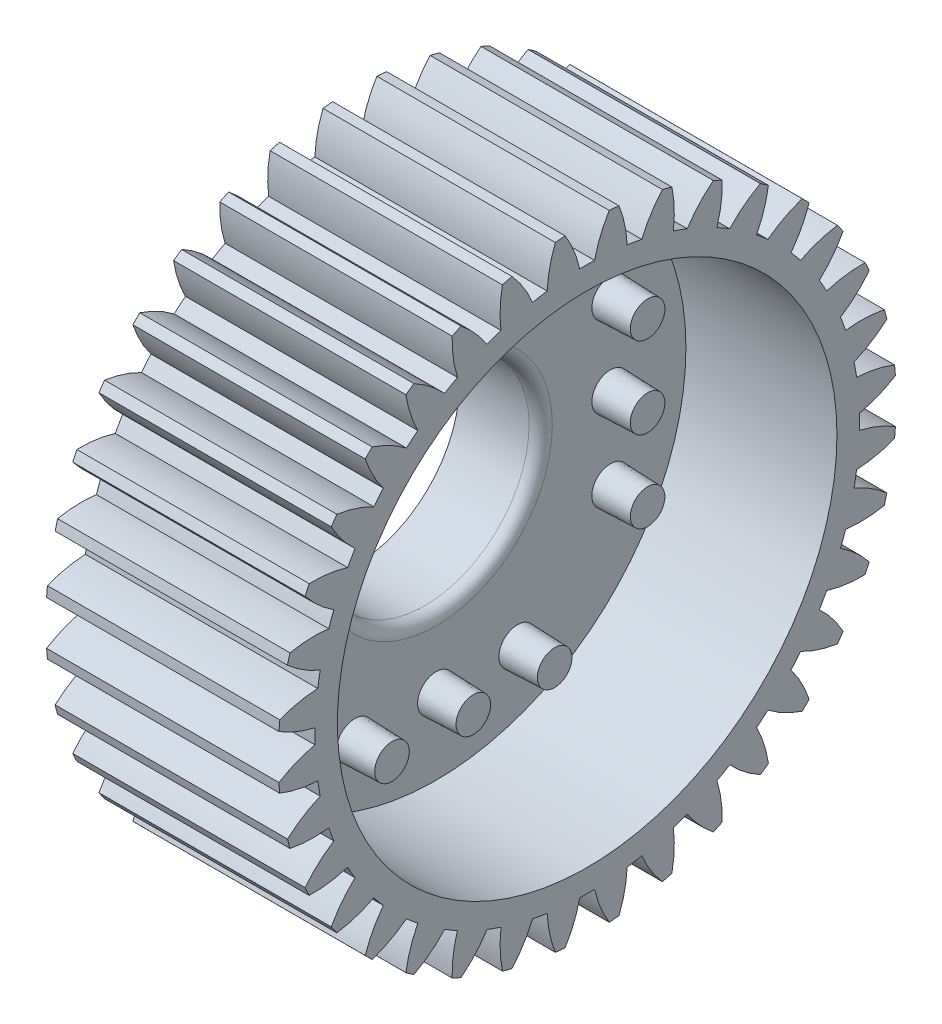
from build123d import *

# Parameters (mm, degrees)
BASPROSKE_W                    = 10
BASPROSKE_H                    = 13.3
TOOTHCUT_DEPTH                 = 22.302112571
TEETHCUTS_COUNT                = 36
BORSKE_R                       = 11
BORE_DEPTH                     = 50.0000508
BOSS_EXTRUDE1_START            = 3.5
SKETCH1_R                      = 11
SKETCH1_R_2                    = 4.5
BOSS_EXTRUDE1_DEPTH            = 3.5
SKETCH2_R                      = 11
SKETCH2_R_2                    = 10.75
BOSS_EXTRUDE2_DEPTH            = 10
SKETCH3_R                      = 0.8
BOSS_EXTRUDE3_DEPTH            = 1.6
BOSS_EXTRUDE3_DRAFT            = 2
BOSS_EXTRUDE3_PROFILE_2_DEPTH  = 1.6
BOSS_EXTRUDE3_PROFILE_2_DRAFT  = 2
BOSS_EXTRUDE3_PROFILE_3_DEPTH  = 1.6
BOSS_EXTRUDE3_PROFILE_3_DRAFT  = 2
BOSS_EXTRUDE3_PROFILE_4_DEPTH  = 1.6
BOSS_EXTRUDE3_PROFILE_4_DRAFT  = 2
BOSS_EXTRUDE3_PROFILE_5_DEPTH  = 1.6
BOSS_EXTRUDE3_PROFILE_5_DRAFT  = 2
BOSS_EXTRUDE3_PROFILE_6_DEPTH  = 1.6
BOSS_EXTRUDE3_PROFILE_6_DRAFT  = 2
BOSS_EXTRUDE3_PROFILE_7_DEPTH  = 1.6
BOSS_EXTRUDE3_PROFILE_7_DRAFT  = 2
BOSS_EXTRUDE3_PROFILE_8_DEPTH  = 1.6
BOSS_EXTRUDE3_PROFILE_8_DRAFT  = 2
BOSS_EXTRUDE3_PROFILE_9_DEPTH  = 1.6
BOSS_EXTRUDE3_PROFILE_9_DRAFT  = 2
BOSS_EXTRUDE3_PROFILE_10_DEPTH = 1.6
BOSS_EXTRUDE3_PROFILE_10_DRAFT = 2
BOSS_EXTRUDE3_PROFILE_11_DEPTH = 1.6
BOSS_EXTRUDE3_PROFILE_11_DRAFT = 2
BOSS_EXTRUDE3_PROFILE_12_DEPTH = 1.6
BOSS_EXTRUDE3_PROFILE_12_DRAFT = 2
FILLET1_R                      = 0.5


with BuildPart() as part:
    # BasProSke → Base-Revolve (revolve)
    with BuildSketch(Plane(origin=(0, 0, 0), x_dir=(1, 0, 0), z_dir=(0, 1, 0)), mode=Mode.PRIVATE) as base_revolve_sk:
        with Locations((5, 6.65)):
            Rectangle(BASPROSKE_W, BASPROSKE_H)
    revolve(base_revolve_sk.sketch.rotate(Axis((-10, 0, 0), (1, 0, 0)), 180), axis=Axis((-10, 0, 0), (1, 0, 0)))

    # TooCutSke → ToothCut (cut, through all)
    with BuildSketch(Plane(origin=(0, 0, 0), x_dir=(0, 0, -1), z_dir=(1, 0, 0))):
        with BuildLine():
            ThreePointArc((0.318850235, 11.719663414), (0, 11.724), (-0.318850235, 11.719663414))
            ThreePointArc((-0.318850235, 11.719663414), (-0.574563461, 12.53243609), (-0.963536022, 13.290518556))
            ThreePointArc((-0.963536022, 13.290518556), (0, 13.3254), (0.963536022, 13.290518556))
            ThreePointArc((0.963536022, 13.290518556), (0.574563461, 12.53243609), (0.318850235, 11.719663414))
        make_face()
    toothcut = extrude(amount=TOOTHCUT_DEPTH, mode=Mode.SUBTRACT)

    # TeethCuts: ToothCut ×36 about axis
    teethcuts_axis = Axis((0, 0, 0), (1, 0, 0))
    for i in range(1, TEETHCUTS_COUNT):
        add(toothcut.rotate(teethcuts_axis, i * 360 / TEETHCUTS_COUNT), mode=Mode.SUBTRACT)

    # BorSke → Bore (cut, symmetric)
    with BuildSketch(Plane(origin=(0, 0, 0), x_dir=(0, 0, -1), z_dir=(1, 0, 0))):
        with Locations(Location((0, 0, 0), (0, 0, 180))):
            Circle(BORSKE_R)
    extrude(amount=BORE_DEPTH, both=True, mode=Mode.SUBTRACT)

    # Sketch1 → Boss-Extrude1 (add)
    with BuildSketch(Plane(origin=(0, 0, 0), x_dir=(0, 0, -1), z_dir=(1, 0, 0)).offset(BOSS_EXTRUDE1_START)):
        with Locations(Location((0, 0, 0), (0, 0, 180))):
            Circle(SKETCH1_R)
        Circle(SKETCH1_R_2, mode=Mode.SUBTRACT)
    extrude(amount=-BOSS_EXTRUDE1_DEPTH)

    # Sketch2 → Boss-Extrude2 (add)
    with BuildSketch(Plane(origin=(10, 0, 0), x_dir=(0, 0, -1), z_dir=(1, 0, 0))):
        Circle(SKETCH2_R)
        Circle(SKETCH2_R_2, mode=Mode.SUBTRACT)
    extrude(amount=-BOSS_EXTRUDE2_DEPTH)


with BuildPart() as boss_extrude3_tool:
    # Sketch3 → Boss-Extrude3 (with draft: the straight prism first)
    with BuildSketch(Plane(origin=(3.5, 0, 0), x_dir=(0, 0, -1), z_dir=(1, 0, 0))):
        with Locations((-3.5, 7.5)):
            Circle(SKETCH3_R)
    extrude(amount=BOSS_EXTRUDE3_DEPTH)
    # Boss-Extrude3: the draft: its side faces are tilted about the plane it starts from
    boss_extrude3_sides = [boss_extrude3_tool.faces().sort_by_distance(p)[0] for p in [
        (4.3, 7.5, 4.3),
    ]]
    draft(boss_extrude3_sides, Plane(origin=(3.5, 0, 0), x_dir=(0, 0, -1), z_dir=(1, 0, 0)), BOSS_EXTRUDE3_DRAFT)


with BuildPart() as part_1:
    add(part.part)

    # Boss-Extrude3: add boss_extrude3_tool
    add(boss_extrude3_tool.part)


with BuildPart() as boss_extrude3_profile_2_tool:
    # Sketch3 → Boss-Extrude3 profile 2 (with draft: the straight prism first)
    with BuildSketch(Plane(origin=(3.5, 0, 0), x_dir=(0, 0, -1), z_dir=(1, 0, 0))):
        with Locations((0, 7.5)):
            Circle(SKETCH3_R)
    extrude(amount=BOSS_EXTRUDE3_PROFILE_2_DEPTH)
    # Boss-Extrude3 profile 2: the draft: its side faces are tilted about the plane it starts from
    boss_extrude3_profile_2_sides = [boss_extrude3_profile_2_tool.faces().sort_by_distance(p)[0] for p in [
        (4.3, 7.5, 0.8),
    ]]
    draft(boss_extrude3_profile_2_sides, Plane(origin=(3.5, 0, 0), x_dir=(0, 0, -1), z_dir=(1, 0, 0)), BOSS_EXTRUDE3_PROFILE_2_DRAFT)


with BuildPart() as part_2:
    add(part_1.part)

    # Boss-Extrude3 profile 2: add boss_extrude3_profile_2_tool
    add(boss_extrude3_profile_2_tool.part)


with BuildPart() as boss_extrude3_profile_3_tool:
    # Sketch3 → Boss-Extrude3 profile 3 (with draft: the straight prism first)
    with BuildSketch(Plane(origin=(3.5, 0, 0), x_dir=(0, 0, -1), z_dir=(1, 0, 0))):
        with Locations((3.5, 7.5)):
            Circle(SKETCH3_R)
    extrude(amount=BOSS_EXTRUDE3_PROFILE_3_DEPTH)
    # Boss-Extrude3 profile 3: the draft: its side faces are tilted about the plane it starts from
    boss_extrude3_profile_3_sides = [boss_extrude3_profile_3_tool.faces().sort_by_distance(p)[0] for p in [
        (4.3, 7.5, -2.7),
    ]]
    draft(boss_extrude3_profile_3_sides, Plane(origin=(3.5, 0, 0), x_dir=(0, 0, -1), z_dir=(1, 0, 0)), BOSS_EXTRUDE3_PROFILE_3_DRAFT)


with BuildPart() as part_3:
    add(part_2.part)

    # Boss-Extrude3 profile 3: add boss_extrude3_profile_3_tool
    add(boss_extrude3_profile_3_tool.part)


with BuildPart() as boss_extrude3_profile_4_tool:
    # Sketch3 → Boss-Extrude3 profile 4 (with draft: the straight prism first)
    with BuildSketch(Plane(origin=(3.5, 0, 0), x_dir=(0, 0, -1), z_dir=(1, 0, 0))):
        with Locations((-7.5, -3.5)):
            Circle(SKETCH3_R)
    extrude(amount=BOSS_EXTRUDE3_PROFILE_4_DEPTH)
    # Boss-Extrude3 profile 4: the draft: its side faces are tilted about the plane it starts from
    boss_extrude3_profile_4_sides = [boss_extrude3_profile_4_tool.faces().sort_by_distance(p)[0] for p in [
        (4.3, -3.5, 8.3),
    ]]
    draft(boss_extrude3_profile_4_sides, Plane(origin=(3.5, 0, 0), x_dir=(0, 0, -1), z_dir=(1, 0, 0)), BOSS_EXTRUDE3_PROFILE_4_DRAFT)


with BuildPart() as part_4:
    add(part_3.part)

    # Boss-Extrude3 profile 4: add boss_extrude3_profile_4_tool
    add(boss_extrude3_profile_4_tool.part)


with BuildPart() as boss_extrude3_profile_5_tool:
    # Sketch3 → Boss-Extrude3 profile 5 (with draft: the straight prism first)
    with BuildSketch(Plane(origin=(3.5, 0, 0), x_dir=(0, 0, -1), z_dir=(1, 0, 0))):
        with Locations((-7.5, 0)):
            Circle(SKETCH3_R)
    extrude(amount=BOSS_EXTRUDE3_PROFILE_5_DEPTH)
    # Boss-Extrude3 profile 5: the draft: its side faces are tilted about the plane it starts from
    boss_extrude3_profile_5_sides = [boss_extrude3_profile_5_tool.faces().sort_by_distance(p)[0] for p in [
        (4.3, 0, 8.3),
    ]]
    draft(boss_extrude3_profile_5_sides, Plane(origin=(3.5, 0, 0), x_dir=(0, 0, -1), z_dir=(1, 0, 0)), BOSS_EXTRUDE3_PROFILE_5_DRAFT)


with BuildPart() as part_5:
    add(part_4.part)

    # Boss-Extrude3 profile 5: add boss_extrude3_profile_5_tool
    add(boss_extrude3_profile_5_tool.part)


with BuildPart() as boss_extrude3_profile_6_tool:
    # Sketch3 → Boss-Extrude3 profile 6 (with draft: the straight prism first)
    with BuildSketch(Plane(origin=(3.5, 0, 0), x_dir=(0, 0, -1), z_dir=(1, 0, 0))):
        with Locations((-7.5, 3.5)):
            Circle(SKETCH3_R)
    extrude(amount=BOSS_EXTRUDE3_PROFILE_6_DEPTH)
    # Boss-Extrude3 profile 6: the draft: its side faces are tilted about the plane it starts from
    boss_extrude3_profile_6_sides = [boss_extrude3_profile_6_tool.faces().sort_by_distance(p)[0] for p in [
        (4.3, 3.5, 8.3),
    ]]
    draft(boss_extrude3_profile_6_sides, Plane(origin=(3.5, 0, 0), x_dir=(0, 0, -1), z_dir=(1, 0, 0)), BOSS_EXTRUDE3_PROFILE_6_DRAFT)


with BuildPart() as part_6:
    add(part_5.part)

    # Boss-Extrude3 profile 6: add boss_extrude3_profile_6_tool
    add(boss_extrude3_profile_6_tool.part)


with BuildPart() as boss_extrude3_profile_7_tool:
    # Sketch3 → Boss-Extrude3 profile 7 (with draft: the straight prism first)
    with BuildSketch(Plane(origin=(3.5, 0, 0), x_dir=(0, 0, -1), z_dir=(1, 0, 0))):
        with Locations((7.5, -3.5)):
            Circle(SKETCH3_R)
    extrude(amount=BOSS_EXTRUDE3_PROFILE_7_DEPTH)
    # Boss-Extrude3 profile 7: the draft: its side faces are tilted about the plane it starts from
    boss_extrude3_profile_7_sides = [boss_extrude3_profile_7_tool.faces().sort_by_distance(p)[0] for p in [
        (4.3, -3.5, -6.7),
    ]]
    draft(boss_extrude3_profile_7_sides, Plane(origin=(3.5, 0, 0), x_dir=(0, 0, -1), z_dir=(1, 0, 0)), BOSS_EXTRUDE3_PROFILE_7_DRAFT)


with BuildPart() as part_7:
    add(part_6.part)

    # Boss-Extrude3 profile 7: add boss_extrude3_profile_7_tool
    add(boss_extrude3_profile_7_tool.part)


with BuildPart() as boss_extrude3_profile_8_tool:
    # Sketch3 → Boss-Extrude3 profile 8 (with draft: the straight prism first)
    with BuildSketch(Plane(origin=(3.5, 0, 0), x_dir=(0, 0, -1), z_dir=(1, 0, 0))):
        with Locations((7.5, 0)):
            Circle(SKETCH3_R)
    extrude(amount=BOSS_EXTRUDE3_PROFILE_8_DEPTH)
    # Boss-Extrude3 profile 8: the draft: its side faces are tilted about the plane it starts from
    boss_extrude3_profile_8_sides = [boss_extrude3_profile_8_tool.faces().sort_by_distance(p)[0] for p in [
        (4.3, 0, -6.7),
    ]]
    draft(boss_extrude3_profile_8_sides, Plane(origin=(3.5, 0, 0), x_dir=(0, 0, -1), z_dir=(1, 0, 0)), BOSS_EXTRUDE3_PROFILE_8_DRAFT)


with BuildPart() as part_8:
    add(part_7.part)

    # Boss-Extrude3 profile 8: add boss_extrude3_profile_8_tool
    add(boss_extrude3_profile_8_tool.part)


with BuildPart() as boss_extrude3_profile_9_tool:
    # Sketch3 → Boss-Extrude3 profile 9 (with draft: the straight prism first)
    with BuildSketch(Plane(origin=(3.5, 0, 0), x_dir=(0, 0, -1), z_dir=(1, 0, 0))):
        with Locations((7.5, 3.5)):
            Circle(SKETCH3_R)
    extrude(amount=BOSS_EXTRUDE3_PROFILE_9_DEPTH)
    # Boss-Extrude3 profile 9: the draft: its side faces are tilted about the plane it starts from
    boss_extrude3_profile_9_sides = [boss_extrude3_profile_9_tool.faces().sort_by_distance(p)[0] for p in [
        (4.3, 3.5, -6.7),
    ]]
    draft(boss_extrude3_profile_9_sides, Plane(origin=(3.5, 0, 0), x_dir=(0, 0, -1), z_dir=(1, 0, 0)), BOSS_EXTRUDE3_PROFILE_9_DRAFT)


with BuildPart() as part_9:
    add(part_8.part)

    # Boss-Extrude3 profile 9: add boss_extrude3_profile_9_tool
    add(boss_extrude3_profile_9_tool.part)


with BuildPart() as boss_extrude3_profile_10_tool:
    # Sketch3 → Boss-Extrude3 profile 10 (with draft: the straight prism first)
    with BuildSketch(Plane(origin=(3.5, 0, 0), x_dir=(0, 0, -1), z_dir=(1, 0, 0))):
        with Locations((3.5, -7.5)):
            Circle(SKETCH3_R)
    extrude(amount=BOSS_EXTRUDE3_PROFILE_10_DEPTH)
    # Boss-Extrude3 profile 10: the draft: its side faces are tilted about the plane it starts from
    boss_extrude3_profile_10_sides = [boss_extrude3_profile_10_tool.faces().sort_by_distance(p)[0] for p in [
        (4.3, -7.5, -2.7),
    ]]
    draft(boss_extrude3_profile_10_sides, Plane(origin=(3.5, 0, 0), x_dir=(0, 0, -1), z_dir=(1, 0, 0)), BOSS_EXTRUDE3_PROFILE_10_DRAFT)


with BuildPart() as part_10:
    add(part_9.part)

    # Boss-Extrude3 profile 10: add boss_extrude3_profile_10_tool
    add(boss_extrude3_profile_10_tool.part)


with BuildPart() as boss_extrude3_profile_11_tool:
    # Sketch3 → Boss-Extrude3 profile 11 (with draft: the straight prism first)
    with BuildSketch(Plane(origin=(3.5, 0, 0), x_dir=(0, 0, -1), z_dir=(1, 0, 0))):
        with Locations((0, -7.5)):
            Circle(SKETCH3_R)
    extrude(amount=BOSS_EXTRUDE3_PROFILE_11_DEPTH)
    # Boss-Extrude3 profile 11: the draft: its side faces are tilted about the plane it starts from
    boss_extrude3_profile_11_sides = [boss_extrude3_profile_11_tool.faces().sort_by_distance(p)[0] for p in [
        (4.3, -7.5, 0.8),
    ]]
    draft(boss_extrude3_profile_11_sides, Plane(origin=(3.5, 0, 0), x_dir=(0, 0, -1), z_dir=(1, 0, 0)), BOSS_EXTRUDE3_PROFILE_11_DRAFT)


with BuildPart() as part_11:
    add(part_10.part)

    # Boss-Extrude3 profile 11: add boss_extrude3_profile_11_tool
    add(boss_extrude3_profile_11_tool.part)


with BuildPart() as boss_extrude3_profile_12_tool:
    # Sketch3 → Boss-Extrude3 profile 12 (with draft: the straight prism first)
    with BuildSketch(Plane(origin=(3.5, 0, 0), x_dir=(0, 0, -1), z_dir=(1, 0, 0))):
        with Locations((-3.5, -7.5)):
            Circle(SKETCH3_R)
    extrude(amount=BOSS_EXTRUDE3_PROFILE_12_DEPTH)
    # Boss-Extrude3 profile 12: the draft: its side faces are tilted about the plane it starts from
    boss_extrude3_profile_12_sides = [boss_extrude3_profile_12_tool.faces().sort_by_distance(p)[0] for p in [
        (4.3, -7.5, 4.3),
    ]]
    draft(boss_extrude3_profile_12_sides, Plane(origin=(3.5, 0, 0), x_dir=(0, 0, -1), z_dir=(1, 0, 0)), BOSS_EXTRUDE3_PROFILE_12_DRAFT)


with BuildPart() as part_12:
    add(part_11.part)

    # Boss-Extrude3 profile 12: add boss_extrude3_profile_12_tool
    add(boss_extrude3_profile_12_tool.part)

    # Fillet1
    fillet1_edges = [part_12.edges().sort_by_distance(p)[0] for p in [
        (3.5, 0, 4.5),
    ]]
    fillet(fillet1_edges, radius=FILLET1_R)


solid = part_12.part
